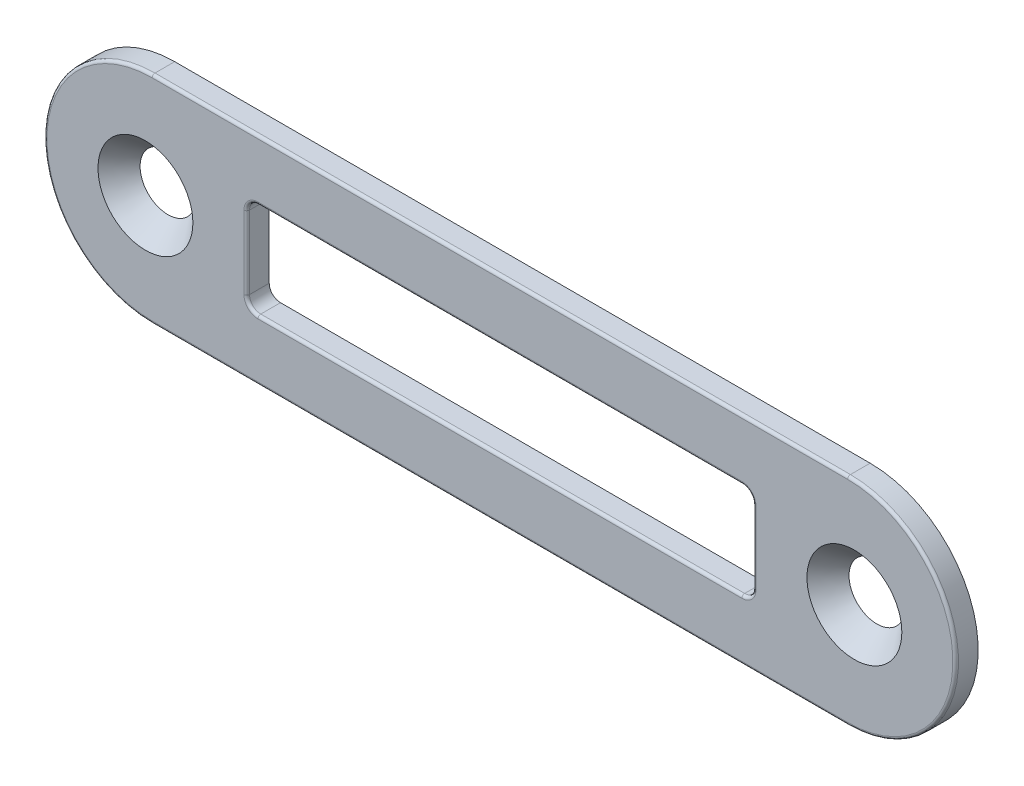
from build123d import *

# Parameters (mm, degrees)
BASE_EXTRUDE_DEPTH                            = 2
SKETCH8_W                                     = 45
SKETCH8_H                                     = 8.5
CUT_EXTRUDE3_DEPTH                            = 74.963504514
SKETCH9_R                                     = 2
CUT_EXTRUDE4_DEPTH                            = 74.963504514
CSK_FOR_8_FLAT_HEAD_MACHINE_SCREW1_AT_2_COUNT = 2
CSK_FOR_8_FLAT_HEAD_MACHINE_SCREW1_AT_2_PITCH = 63
FILLET2_R                                     = 1
FILLET1_R                                     = 0.25


with BuildPart() as part:
    # Sketch3 → Base-Extrude (new body)
    with BuildSketch(Plane.XY):
        with BuildLine():
            Line((0, 0), (61.8, 0))
            ThreePointArc((61.8, 0), (71.4, 9.6), (61.8, 19.2))
            Line((61.8, 19.2), (0, 19.2))
            ThreePointArc((0, 19.2), (-9.6, 9.6), (0, 0))
        make_face()
    extrude(amount=BASE_EXTRUDE_DEPTH)

    # Sketch8 → Cut-Extrude3 (cut, through all)
    with BuildSketch(Plane.XY.offset(2)):
        with Locations((30.9, 9.6)):
            Rectangle(SKETCH8_W, SKETCH8_H)
    extrude(amount=-CUT_EXTRUDE3_DEPTH, mode=Mode.SUBTRACT)

    # Sketch9 → Cut-Extrude4 (cut, through all)
    with BuildSketch(Plane.XY.offset(2)):
        with Locations((-0.6, 9.6)):
            Circle(SKETCH9_R)
        with Locations((62.4, 9.6)):
            Circle(SKETCH9_R)
    extrude(amount=-CUT_EXTRUDE4_DEPTH, mode=Mode.SUBTRACT)

    # Sketch11 → CSK for _8 Flat Head Machine Screw1 (revolve, cut)
    with BuildSketch(Plane(origin=(-0.6, 9.6, 2), x_dir=(0, -1, 0), z_dir=(1, 0, 0))):
        Polygon((0, 0), (0, 2), (2.2479, 2), (2.2479, 2.26450021), (4.2164, 0), align=None)
    csk_for_8_flat_head_machine_screw1 = revolve(axis=Axis((-0.6, 9.6, 8.35), (0, 0, -1)), mode=Mode.SUBTRACT)

    # CSK for _8 Flat Head Machine Screw1 at 2: CSK for _8 Flat Head Machine Screw1 ×2
    with Locations(*[(i * CSK_FOR_8_FLAT_HEAD_MACHINE_SCREW1_AT_2_PITCH, 0, 0) for i in range(1, CSK_FOR_8_FLAT_HEAD_MACHINE_SCREW1_AT_2_COUNT)]):
        add(csk_for_8_flat_head_machine_screw1, mode=Mode.SUBTRACT)

    # Fillet2
    fillet2_edges = [part.edges().sort_by_distance(p)[0] for p in [
        (53.4, 13.85, 1),
        (53.4, 5.35, 1),
        (8.4, 5.35, 1),
        (8.4, 13.85, 1),
    ]]
    fillet(fillet2_edges, radius=FILLET2_R)

    # Fillet1
    fillet1_edges = [part.edges().sort_by_distance(p)[0] for p in [
        (71.4, 9.6, 2),
        (30.9, 19.2, 2),
        (-9.6, 9.6, 2),
        (30.9, 13.85, 2),
        (53.4, 9.6, 2),
        (30.9, 5.35, 2),
        (8.4, 9.6, 2),
        (53.107106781, 13.557106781, 2),
        (53.107106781, 5.642893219, 2),
        (8.692893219, 5.642893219, 2),
        (30.9, 0, 2),
        (8.692893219, 13.557106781, 2),
    ]]
    fillet(fillet1_edges, radius=FILLET1_R)


solid = part.part
